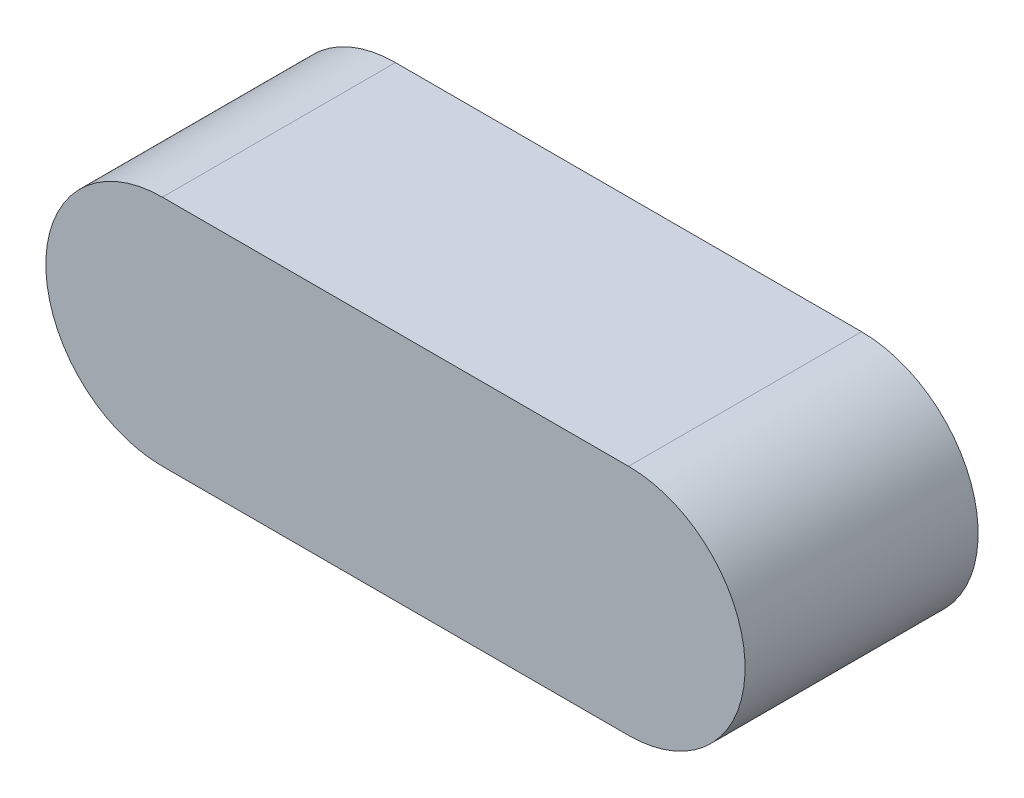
ISO-10303-21;
HEADER;
FILE_DESCRIPTION(('STEP AP214'),'2;1');
FILE_NAME('part.step','',(''),(''),'','','');
FILE_SCHEMA(('AUTOMOTIVE_DESIGN { 1 0 10303 214 1 1 1 1 }'));
ENDSEC;
DATA;
#1=APPLICATION_CONTEXT('core data for automotive mechanical design processes');
#2=APPLICATION_PROTOCOL_DEFINITION('international standard','automotive_design',2000,#1);
#3=PRODUCT_CONTEXT('',#1,'mechanical');
#4=PRODUCT('Part','Part','',(#3));
#5=PRODUCT_RELATED_PRODUCT_CATEGORY('part','',(#4));
#6=PRODUCT_DEFINITION_FORMATION('','',#4);
#7=PRODUCT_DEFINITION_CONTEXT('part definition',#1,'design');
#8=PRODUCT_DEFINITION('design','',#6,#7);
#9=PRODUCT_DEFINITION_SHAPE('','',#8);
#10=(LENGTH_UNIT() NAMED_UNIT(*) SI_UNIT(.MILLI.,.METRE.));
#11=(NAMED_UNIT(*) PLANE_ANGLE_UNIT() SI_UNIT($,.RADIAN.));
#12=(NAMED_UNIT(*) SI_UNIT($,.STERADIAN.) SOLID_ANGLE_UNIT());
#13=UNCERTAINTY_MEASURE_WITH_UNIT(LENGTH_MEASURE(1.E-05),#10,'distance_accuracy_value','');
#14=(GEOMETRIC_REPRESENTATION_CONTEXT(3) GLOBAL_UNCERTAINTY_ASSIGNED_CONTEXT((#13)) GLOBAL_UNIT_ASSIGNED_CONTEXT((#10,
#11,#12)) REPRESENTATION_CONTEXT('',''));
#15=CARTESIAN_POINT('',(0.,0.,0.));
#16=DIRECTION('',(0.,0.,1.));
#17=DIRECTION('',(1.,0.,0.));
#18=AXIS2_PLACEMENT_3D('',#15,#16,#17);
#19=CARTESIAN_POINT('',(-71.1107458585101,0.,4.));
#20=DIRECTION('',(0.,0.,-1.));
#21=DIRECTION('',(-1.,0.,0.));
#22=AXIS2_PLACEMENT_3D('',#19,#20,#21);
#23=CYLINDRICAL_SURFACE('',#22,2.);
#24=CARTESIAN_POINT('',(-71.1107458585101,0.,0.));
#25=DIRECTION('',(0.,0.,1.));
#26=DIRECTION('',(1.,0.,0.));
#27=AXIS2_PLACEMENT_3D('',#24,#25,#26);
#28=CIRCLE('',#27,2.);
#29=CARTESIAN_POINT('',(-71.1107458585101,2.,0.));
#30=VERTEX_POINT('',#29);
#31=CARTESIAN_POINT('',(-71.1107458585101,-2.,0.));
#32=VERTEX_POINT('',#31);
#33=EDGE_CURVE('E94',#30,#32,#28,.T.);
#34=ORIENTED_EDGE('',*,*,#33,.T.);
#35=DIRECTION('',(0.,0.,-1.));
#36=VECTOR('',#35,1.);
#37=CARTESIAN_POINT('',(-71.1107458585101,-2.,4.));
#38=LINE('',#37,#36);
#39=CARTESIAN_POINT('',(-71.1107458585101,-2.,4.));
#40=VERTEX_POINT('',#39);
#41=EDGE_CURVE('E11',#40,#32,#38,.T.);
#42=ORIENTED_EDGE('',*,*,#41,.F.);
#43=CARTESIAN_POINT('',(-71.1107458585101,0.,4.));
#44=DIRECTION('',(0.,0.,1.));
#45=DIRECTION('',(1.,0.,0.));
#46=AXIS2_PLACEMENT_3D('',#43,#44,#45);
#47=CIRCLE('',#46,2.);
#48=CARTESIAN_POINT('',(-71.1107458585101,2.,4.));
#49=VERTEX_POINT('',#48);
#50=EDGE_CURVE('E82',#49,#40,#47,.T.);
#51=ORIENTED_EDGE('',*,*,#50,.F.);
#52=DIRECTION('',(0.,0.,-1.));
#53=VECTOR('',#52,1.);
#54=CARTESIAN_POINT('',(-71.1107458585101,2.,4.));
#55=LINE('',#54,#53);
#56=EDGE_CURVE('E90',#49,#30,#55,.T.);
#57=ORIENTED_EDGE('',*,*,#56,.T.);
#58=EDGE_LOOP('',(#34,#42,#51,#57));
#59=FACE_BOUND('',#58,.T.);
#60=ADVANCED_FACE('F31',(#59),#23,.T.);
#61=CARTESIAN_POINT('',(-63.1107458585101,-2.00000000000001,4.));
#62=DIRECTION('',(0.,1.,0.));
#63=DIRECTION('',(-1.,0.,0.));
#64=AXIS2_PLACEMENT_3D('',#61,#62,#63);
#65=PLANE('',#64);
#66=DIRECTION('',(1.,0.,0.));
#67=VECTOR('',#66,1.);
#68=CARTESIAN_POINT('',(-63.1107458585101,-2.00000000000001,0.));
#69=LINE('',#68,#67);
#70=CARTESIAN_POINT('',(-63.1107458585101,-2.00000000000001,0.));
#71=VERTEX_POINT('',#70);
#72=EDGE_CURVE('E86',#32,#71,#69,.T.);
#73=ORIENTED_EDGE('',*,*,#72,.T.);
#74=DIRECTION('',(0.,0.,-1.));
#75=VECTOR('',#74,1.);
#76=CARTESIAN_POINT('',(-63.1107458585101,-2.00000000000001,4.));
#77=LINE('',#76,#75);
#78=CARTESIAN_POINT('',(-63.1107458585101,-2.00000000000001,4.));
#79=VERTEX_POINT('',#78);
#80=EDGE_CURVE('E39',#79,#71,#77,.T.);
#81=ORIENTED_EDGE('',*,*,#80,.F.);
#82=DIRECTION('',(1.,0.,0.));
#83=VECTOR('',#82,1.);
#84=CARTESIAN_POINT('',(-63.1107458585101,-2.00000000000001,4.));
#85=LINE('',#84,#83);
#86=EDGE_CURVE('E77',#40,#79,#85,.T.);
#87=ORIENTED_EDGE('',*,*,#86,.F.);
#88=ORIENTED_EDGE('',*,*,#41,.T.);
#89=EDGE_LOOP('',(#73,#81,#87,#88));
#90=FACE_BOUND('',#89,.T.);
#91=ADVANCED_FACE('F85',(#90),#65,.F.);
#92=CARTESIAN_POINT('',(-63.1107458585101,0.,4.));
#93=DIRECTION('',(0.,0.,-1.));
#94=DIRECTION('',(-1.,0.,0.));
#95=AXIS2_PLACEMENT_3D('',#92,#93,#94);
#96=CYLINDRICAL_SURFACE('',#95,2.);
#97=CARTESIAN_POINT('',(-63.1107458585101,0.,0.));
#98=DIRECTION('',(0.,0.,1.));
#99=DIRECTION('',(1.,0.,0.));
#100=AXIS2_PLACEMENT_3D('',#97,#98,#99);
#101=CIRCLE('',#100,2.);
#102=CARTESIAN_POINT('',(-63.1107458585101,2.,0.));
#103=VERTEX_POINT('',#102);
#104=EDGE_CURVE('E64',#71,#103,#101,.T.);
#105=ORIENTED_EDGE('',*,*,#104,.T.);
#106=DIRECTION('',(0.,0.,-1.));
#107=VECTOR('',#106,1.);
#108=CARTESIAN_POINT('',(-63.1107458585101,2.,4.));
#109=LINE('',#108,#107);
#110=CARTESIAN_POINT('',(-63.1107458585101,2.,4.));
#111=VERTEX_POINT('',#110);
#112=EDGE_CURVE('E87',#111,#103,#109,.T.);
#113=ORIENTED_EDGE('',*,*,#112,.F.);
#114=CARTESIAN_POINT('',(-63.1107458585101,0.,4.));
#115=DIRECTION('',(0.,0.,1.));
#116=DIRECTION('',(1.,0.,0.));
#117=AXIS2_PLACEMENT_3D('',#114,#115,#116);
#118=CIRCLE('',#117,2.);
#119=EDGE_CURVE('E80',#79,#111,#118,.T.);
#120=ORIENTED_EDGE('',*,*,#119,.F.);
#121=ORIENTED_EDGE('',*,*,#80,.T.);
#122=EDGE_LOOP('',(#105,#113,#120,#121));
#123=FACE_BOUND('',#122,.T.);
#124=ADVANCED_FACE('F88',(#123),#96,.T.);
#125=CARTESIAN_POINT('',(-71.1107458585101,2.,4.));
#126=DIRECTION('',(0.,-1.,0.));
#127=DIRECTION('',(1.,0.,0.));
#128=AXIS2_PLACEMENT_3D('',#125,#126,#127);
#129=PLANE('',#128);
#130=DIRECTION('',(-1.,0.,0.));
#131=VECTOR('',#130,1.);
#132=CARTESIAN_POINT('',(-71.1107458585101,2.,0.));
#133=LINE('',#132,#131);
#134=EDGE_CURVE('E70',#103,#30,#133,.T.);
#135=ORIENTED_EDGE('',*,*,#134,.T.);
#136=ORIENTED_EDGE('',*,*,#56,.F.);
#137=DIRECTION('',(-1.,0.,0.));
#138=VECTOR('',#137,1.);
#139=CARTESIAN_POINT('',(-71.1107458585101,2.,4.));
#140=LINE('',#139,#138);
#141=EDGE_CURVE('E47',#111,#49,#140,.T.);
#142=ORIENTED_EDGE('',*,*,#141,.F.);
#143=ORIENTED_EDGE('',*,*,#112,.T.);
#144=EDGE_LOOP('',(#135,#136,#142,#143));
#145=FACE_BOUND('',#144,.T.);
#146=ADVANCED_FACE('F101',(#145),#129,.F.);
#147=CARTESIAN_POINT('',(-71.1107458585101,0.,4.));
#148=DIRECTION('',(0.,0.,1.));
#149=DIRECTION('',(1.,0.,0.));
#150=AXIS2_PLACEMENT_3D('',#147,#148,#149);
#151=PLANE('',#150);
#152=ORIENTED_EDGE('',*,*,#50,.T.);
#153=ORIENTED_EDGE('',*,*,#86,.T.);
#154=ORIENTED_EDGE('',*,*,#119,.T.);
#155=ORIENTED_EDGE('',*,*,#141,.T.);
#156=EDGE_LOOP('',(#152,#153,#154,#155));
#157=FACE_BOUND('',#156,.T.);
#158=ADVANCED_FACE('F78',(#157),#151,.T.);
#159=CARTESIAN_POINT('',(-71.1107458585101,0.,0.));
#160=DIRECTION('',(0.,0.,1.));
#161=DIRECTION('',(1.,0.,0.));
#162=AXIS2_PLACEMENT_3D('',#159,#160,#161);
#163=PLANE('',#162);
#164=ORIENTED_EDGE('',*,*,#33,.F.);
#165=ORIENTED_EDGE('',*,*,#134,.F.);
#166=ORIENTED_EDGE('',*,*,#104,.F.);
#167=ORIENTED_EDGE('',*,*,#72,.F.);
#168=EDGE_LOOP('',(#164,#165,#166,#167));
#169=FACE_BOUND('',#168,.T.);
#170=ADVANCED_FACE('F104',(#169),#163,.F.);
#171=CLOSED_SHELL('',(#60,#91,#124,#146,#158,#170));
#172=MANIFOLD_SOLID_BREP('B2',#171);
#173=ADVANCED_BREP_SHAPE_REPRESENTATION('',(#18,#172),#14);
#174=SHAPE_DEFINITION_REPRESENTATION(#9,#173);
ENDSEC;
END-ISO-10303-21;
